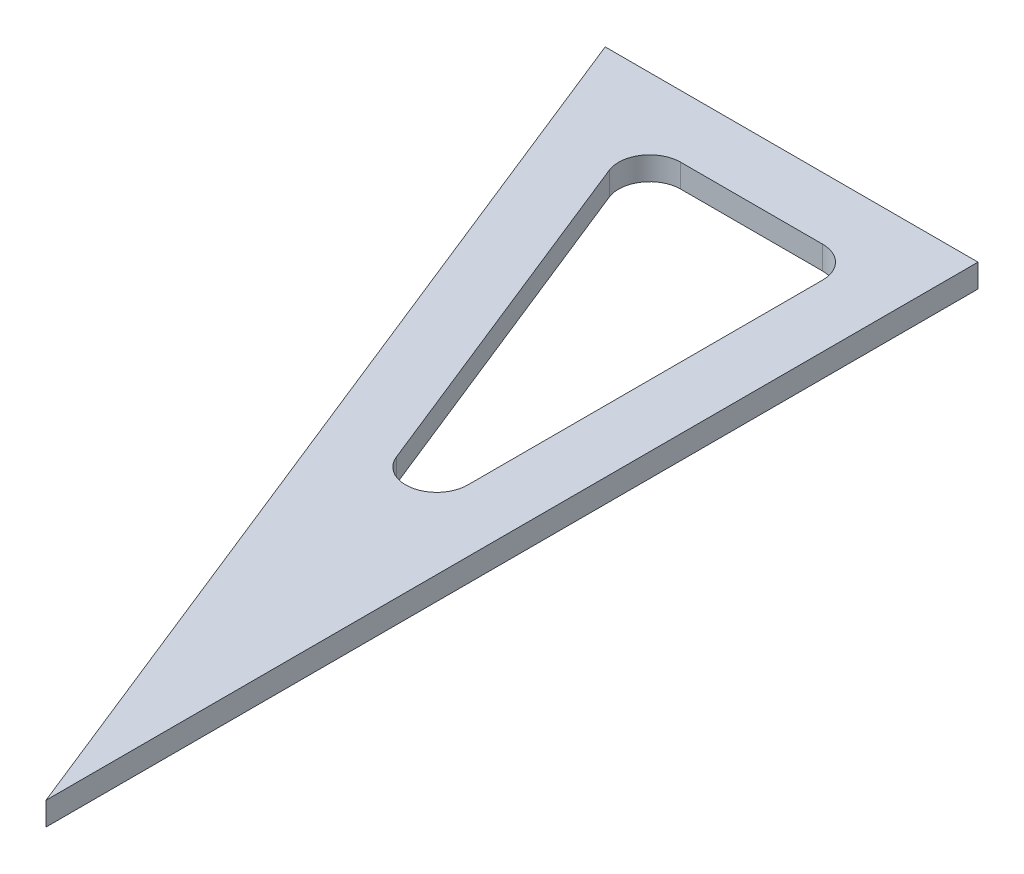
ISO-10303-21;
HEADER;
FILE_DESCRIPTION(('STEP AP214'),'2;1');
FILE_NAME('part.step','',(''),(''),'','','');
FILE_SCHEMA(('AUTOMOTIVE_DESIGN { 1 0 10303 214 1 1 1 1 }'));
ENDSEC;
DATA;
#1=APPLICATION_CONTEXT('core data for automotive mechanical design processes');
#2=APPLICATION_PROTOCOL_DEFINITION('international standard','automotive_design',2000,#1);
#3=PRODUCT_CONTEXT('',#1,'mechanical');
#4=PRODUCT('Part','Part','',(#3));
#5=PRODUCT_RELATED_PRODUCT_CATEGORY('part','',(#4));
#6=PRODUCT_DEFINITION_FORMATION('','',#4);
#7=PRODUCT_DEFINITION_CONTEXT('part definition',#1,'design');
#8=PRODUCT_DEFINITION('design','',#6,#7);
#9=PRODUCT_DEFINITION_SHAPE('','',#8);
#10=(LENGTH_UNIT() NAMED_UNIT(*) SI_UNIT(.MILLI.,.METRE.));
#11=(NAMED_UNIT(*) PLANE_ANGLE_UNIT() SI_UNIT($,.RADIAN.));
#12=(NAMED_UNIT(*) SI_UNIT($,.STERADIAN.) SOLID_ANGLE_UNIT());
#13=UNCERTAINTY_MEASURE_WITH_UNIT(LENGTH_MEASURE(1.E-05),#10,'distance_accuracy_value','');
#14=(GEOMETRIC_REPRESENTATION_CONTEXT(3) GLOBAL_UNCERTAINTY_ASSIGNED_CONTEXT((#13)) GLOBAL_UNIT_ASSIGNED_CONTEXT((#10,
#11,#12)) REPRESENTATION_CONTEXT('',''));
#15=CARTESIAN_POINT('',(0.,0.,0.));
#16=DIRECTION('',(0.,0.,1.));
#17=DIRECTION('',(1.,0.,0.));
#18=AXIS2_PLACEMENT_3D('',#15,#16,#17);
#19=CARTESIAN_POINT('',(-11.3462064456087,218.452208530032,190.5));
#20=DIRECTION('',(-1.,0.,0.));
#21=DIRECTION('',(0.,0.,1.));
#22=AXIS2_PLACEMENT_3D('',#19,#20,#21);
#23=PLANE('',#22);
#24=DIRECTION('',(0.,1.,0.));
#25=VECTOR('',#24,1.);
#26=CARTESIAN_POINT('',(-11.3462064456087,218.452208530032,0.));
#27=LINE('',#26,#25);
#28=CARTESIAN_POINT('',(-11.3462064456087,213.689708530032,0.));
#29=VERTEX_POINT('',#28);
#30=CARTESIAN_POINT('',(-11.3462064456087,218.452208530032,0.));
#31=VERTEX_POINT('',#30);
#32=EDGE_CURVE('E114',#29,#31,#27,.T.);
#33=ORIENTED_EDGE('',*,*,#32,.T.);
#34=DIRECTION('',(0.,0.,-1.));
#35=VECTOR('',#34,1.);
#36=CARTESIAN_POINT('',(-11.3462064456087,218.452208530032,190.5));
#37=LINE('',#36,#35);
#38=CARTESIAN_POINT('',(-11.3462064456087,218.452208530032,190.5));
#39=VERTEX_POINT('',#38);
#40=EDGE_CURVE('E124',#39,#31,#37,.T.);
#41=ORIENTED_EDGE('',*,*,#40,.F.);
#42=DIRECTION('',(0.,1.,0.));
#43=VECTOR('',#42,1.);
#44=CARTESIAN_POINT('',(-11.3462064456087,218.452208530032,190.5));
#45=LINE('',#44,#43);
#46=CARTESIAN_POINT('',(-11.3462064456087,213.689708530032,190.5));
#47=VERTEX_POINT('',#46);
#48=EDGE_CURVE('E108',#47,#39,#45,.T.);
#49=ORIENTED_EDGE('',*,*,#48,.F.);
#50=DIRECTION('',(0.,0.,-1.));
#51=VECTOR('',#50,1.);
#52=CARTESIAN_POINT('',(-11.3462064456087,213.689708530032,190.5));
#53=LINE('',#52,#51);
#54=EDGE_CURVE('E118',#47,#29,#53,.T.);
#55=ORIENTED_EDGE('',*,*,#54,.T.);
#56=EDGE_LOOP('',(#33,#41,#49,#55));
#57=FACE_BOUND('',#56,.T.);
#58=ADVANCED_FACE('F33',(#57),#23,.F.);
#59=CARTESIAN_POINT('',(-11.3462064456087,218.452208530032,190.5));
#60=DIRECTION('',(0.,-1.,0.));
#61=DIRECTION('',(0.,0.,-1.));
#62=AXIS2_PLACEMENT_3D('',#59,#60,#61);
#63=PLANE('',#62);
#64=DIRECTION('',(0.371390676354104,0.,0.928476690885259));
#65=VECTOR('',#64,1.);
#66=CARTESIAN_POINT('',(-68.787887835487,218.452208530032,12.7));
#67=LINE('',#66,#65);
#68=CARTESIAN_POINT('',(-65.3045555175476,218.452208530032,21.4083307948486));
#69=VERTEX_POINT('',#68);
#70=CARTESIAN_POINT('',(-36.2920334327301,218.452208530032,93.9396360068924));
#71=VERTEX_POINT('',#70);
#72=EDGE_CURVE('E165',#69,#71,#67,.T.);
#73=ORIENTED_EDGE('',*,*,#72,.F.);
#74=CARTESIAN_POINT('',(-59.4087285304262,218.452208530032,19.05));
#75=DIRECTION('',(0.,-1.,0.));
#76=DIRECTION('',(0.,0.,-1.));
#77=AXIS2_PLACEMENT_3D('',#74,#75,#76);
#78=CIRCLE('',#77,6.35);
#79=CARTESIAN_POINT('',(-59.4087285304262,218.452208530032,12.7));
#80=VERTEX_POINT('',#79);
#81=EDGE_CURVE('E41',#69,#80,#78,.T.);
#82=ORIENTED_EDGE('',*,*,#81,.T.);
#83=DIRECTION('',(-1.,0.,0.));
#84=VECTOR('',#83,1.);
#85=CARTESIAN_POINT('',(-24.0462064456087,218.452208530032,12.7));
#86=LINE('',#85,#84);
#87=CARTESIAN_POINT('',(-30.3962064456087,218.452208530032,12.7));
#88=VERTEX_POINT('',#87);
#89=EDGE_CURVE('E163',#88,#80,#86,.T.);
#90=ORIENTED_EDGE('',*,*,#89,.F.);
#91=CARTESIAN_POINT('',(-30.3962064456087,218.452208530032,19.05));
#92=DIRECTION('',(0.,-1.,0.));
#93=DIRECTION('',(0.,0.,-1.));
#94=AXIS2_PLACEMENT_3D('',#91,#92,#93);
#95=CIRCLE('',#94,6.35);
#96=CARTESIAN_POINT('',(-24.0462064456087,218.452208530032,19.05));
#97=VERTEX_POINT('',#96);
#98=EDGE_CURVE('E156',#88,#97,#95,.T.);
#99=ORIENTED_EDGE('',*,*,#98,.T.);
#100=DIRECTION('',(0.,0.,-1.));
#101=VECTOR('',#100,1.);
#102=CARTESIAN_POINT('',(-24.0462064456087,218.452208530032,124.554203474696));
#103=LINE('',#102,#101);
#104=CARTESIAN_POINT('',(-24.0462064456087,218.452208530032,91.5813052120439));
#105=VERTEX_POINT('',#104);
#106=EDGE_CURVE('E183',#105,#97,#103,.T.);
#107=ORIENTED_EDGE('',*,*,#106,.F.);
#108=CARTESIAN_POINT('',(-30.3962064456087,218.452208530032,91.5813052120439));
#109=DIRECTION('',(0.,-1.,0.));
#110=DIRECTION('',(0.,0.,-1.));
#111=AXIS2_PLACEMENT_3D('',#108,#109,#110);
#112=CIRCLE('',#111,6.35);
#113=EDGE_CURVE('E152',#105,#71,#112,.T.);
#114=ORIENTED_EDGE('',*,*,#113,.T.);
#115=EDGE_LOOP('',(#73,#82,#90,#99,#107,#114));
#116=FACE_BOUND('',#115,.T.);
#117=DIRECTION('',(-1.,0.,0.));
#118=VECTOR('',#117,1.);
#119=CARTESIAN_POINT('',(-11.3462064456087,218.452208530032,0.));
#120=LINE('',#119,#118);
#121=CARTESIAN_POINT('',(-87.5462064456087,218.452208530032,0.));
#122=VERTEX_POINT('',#121);
#123=EDGE_CURVE('E133',#31,#122,#120,.T.);
#124=ORIENTED_EDGE('',*,*,#123,.T.);
#125=DIRECTION('',(-0.371390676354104,0.,-0.928476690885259));
#126=VECTOR('',#125,1.);
#127=CARTESIAN_POINT('',(-87.5462064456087,218.452208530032,0.));
#128=LINE('',#127,#126);
#129=EDGE_CURVE('E115',#39,#122,#128,.T.);
#130=ORIENTED_EDGE('',*,*,#129,.F.);
#131=ORIENTED_EDGE('',*,*,#40,.T.);
#132=EDGE_LOOP('',(#124,#130,#131));
#133=FACE_BOUND('',#132,.T.);
#134=ADVANCED_FACE('F161',(#116,#133),#63,.F.);
#135=CARTESIAN_POINT('',(-11.3462064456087,213.689708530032,190.5));
#136=DIRECTION('',(0.,1.,0.));
#137=DIRECTION('',(0.,0.,1.));
#138=AXIS2_PLACEMENT_3D('',#135,#136,#137);
#139=PLANE('',#138);
#140=DIRECTION('',(0.371390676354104,0.,0.928476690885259));
#141=VECTOR('',#140,1.);
#142=CARTESIAN_POINT('',(-68.787887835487,213.689708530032,12.7));
#143=LINE('',#142,#141);
#144=CARTESIAN_POINT('',(-65.3045555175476,213.689708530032,21.4083307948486));
#145=VERTEX_POINT('',#144);
#146=CARTESIAN_POINT('',(-36.2920334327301,213.689708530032,93.9396360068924));
#147=VERTEX_POINT('',#146);
#148=EDGE_CURVE('E174',#145,#147,#143,.T.);
#149=ORIENTED_EDGE('',*,*,#148,.T.);
#150=CARTESIAN_POINT('',(-30.3962064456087,213.689708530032,91.5813052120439));
#151=DIRECTION('',(0.,1.,0.));
#152=DIRECTION('',(0.,0.,1.));
#153=AXIS2_PLACEMENT_3D('',#150,#151,#152);
#154=CIRCLE('',#153,6.35);
#155=CARTESIAN_POINT('',(-24.0462064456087,213.689708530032,91.5813052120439));
#156=VERTEX_POINT('',#155);
#157=EDGE_CURVE('E154',#147,#156,#154,.T.);
#158=ORIENTED_EDGE('',*,*,#157,.T.);
#159=DIRECTION('',(0.,0.,-1.));
#160=VECTOR('',#159,1.);
#161=CARTESIAN_POINT('',(-24.0462064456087,213.689708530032,124.554203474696));
#162=LINE('',#161,#160);
#163=CARTESIAN_POINT('',(-24.0462064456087,213.689708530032,19.05));
#164=VERTEX_POINT('',#163);
#165=EDGE_CURVE('E180',#156,#164,#162,.T.);
#166=ORIENTED_EDGE('',*,*,#165,.T.);
#167=CARTESIAN_POINT('',(-30.3962064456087,213.689708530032,19.05));
#168=DIRECTION('',(0.,1.,0.));
#169=DIRECTION('',(0.,0.,1.));
#170=AXIS2_PLACEMENT_3D('',#167,#168,#169);
#171=CIRCLE('',#170,6.35);
#172=CARTESIAN_POINT('',(-30.3962064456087,213.689708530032,12.7));
#173=VERTEX_POINT('',#172);
#174=EDGE_CURVE('E55',#164,#173,#171,.T.);
#175=ORIENTED_EDGE('',*,*,#174,.T.);
#176=DIRECTION('',(-1.,0.,0.));
#177=VECTOR('',#176,1.);
#178=CARTESIAN_POINT('',(-24.0462064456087,213.689708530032,12.7));
#179=LINE('',#178,#177);
#180=CARTESIAN_POINT('',(-59.4087285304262,213.689708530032,12.7));
#181=VERTEX_POINT('',#180);
#182=EDGE_CURVE('E176',#173,#181,#179,.T.);
#183=ORIENTED_EDGE('',*,*,#182,.T.);
#184=CARTESIAN_POINT('',(-59.4087285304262,213.689708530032,19.05));
#185=DIRECTION('',(0.,1.,0.));
#186=DIRECTION('',(0.,0.,1.));
#187=AXIS2_PLACEMENT_3D('',#184,#185,#186);
#188=CIRCLE('',#187,6.35);
#189=EDGE_CURVE('E11',#181,#145,#188,.T.);
#190=ORIENTED_EDGE('',*,*,#189,.T.);
#191=EDGE_LOOP('',(#149,#158,#166,#175,#183,#190));
#192=FACE_BOUND('',#191,.T.);
#193=ORIENTED_EDGE('',*,*,#54,.F.);
#194=DIRECTION('',(-0.371390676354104,0.,-0.928476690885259));
#195=VECTOR('',#194,1.);
#196=CARTESIAN_POINT('',(-87.5462064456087,213.689708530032,0.));
#197=LINE('',#196,#195);
#198=CARTESIAN_POINT('',(-87.5462064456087,213.689708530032,0.));
#199=VERTEX_POINT('',#198);
#200=EDGE_CURVE('E104',#47,#199,#197,.T.);
#201=ORIENTED_EDGE('',*,*,#200,.T.);
#202=DIRECTION('',(1.,0.,0.));
#203=VECTOR('',#202,1.);
#204=CARTESIAN_POINT('',(-11.3462064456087,213.689708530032,0.));
#205=LINE('',#204,#203);
#206=EDGE_CURVE('E120',#199,#29,#205,.T.);
#207=ORIENTED_EDGE('',*,*,#206,.T.);
#208=EDGE_LOOP('',(#193,#201,#207));
#209=FACE_BOUND('',#208,.T.);
#210=ADVANCED_FACE('F119',(#192,#209),#139,.F.);
#211=CARTESIAN_POINT('',(-11.3462064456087,213.689708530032,0.));
#212=DIRECTION('',(0.,0.,-1.));
#213=DIRECTION('',(-1.,0.,0.));
#214=AXIS2_PLACEMENT_3D('',#211,#212,#213);
#215=PLANE('',#214);
#216=ORIENTED_EDGE('',*,*,#32,.F.);
#217=ORIENTED_EDGE('',*,*,#206,.F.);
#218=DIRECTION('',(0.,-1.,0.));
#219=VECTOR('',#218,1.);
#220=CARTESIAN_POINT('',(-87.5462064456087,218.452208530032,0.));
#221=LINE('',#220,#219);
#222=EDGE_CURVE('E111',#122,#199,#221,.T.);
#223=ORIENTED_EDGE('',*,*,#222,.F.);
#224=ORIENTED_EDGE('',*,*,#123,.F.);
#225=EDGE_LOOP('',(#216,#217,#223,#224));
#226=FACE_BOUND('',#225,.T.);
#227=ADVANCED_FACE('F213',(#226),#215,.T.);
#228=CARTESIAN_POINT('',(-87.5462064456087,213.689708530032,0.));
#229=DIRECTION('',(0.928476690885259,0.,-0.371390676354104));
#230=DIRECTION('',(-0.371390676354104,0.,-0.928476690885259));
#231=AXIS2_PLACEMENT_3D('',#228,#229,#230);
#232=PLANE('',#231);
#233=ORIENTED_EDGE('',*,*,#129,.T.);
#234=ORIENTED_EDGE('',*,*,#222,.T.);
#235=ORIENTED_EDGE('',*,*,#200,.F.);
#236=ORIENTED_EDGE('',*,*,#48,.T.);
#237=EDGE_LOOP('',(#233,#234,#235,#236));
#238=FACE_BOUND('',#237,.T.);
#239=ADVANCED_FACE('F106',(#238),#232,.F.);
#240=CARTESIAN_POINT('',(-24.0462064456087,213.689708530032,12.7));
#241=DIRECTION('',(0.,0.,-1.));
#242=DIRECTION('',(-1.,0.,0.));
#243=AXIS2_PLACEMENT_3D('',#240,#241,#242);
#244=PLANE('',#243);
#245=ORIENTED_EDGE('',*,*,#182,.F.);
#246=DIRECTION('',(0.,1.,0.));
#247=VECTOR('',#246,1.);
#248=CARTESIAN_POINT('',(-30.3962064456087,218.452208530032,12.7));
#249=LINE('',#248,#247);
#250=EDGE_CURVE('E149',#173,#88,#249,.T.);
#251=ORIENTED_EDGE('',*,*,#250,.T.);
#252=ORIENTED_EDGE('',*,*,#89,.T.);
#253=DIRECTION('',(0.,1.,0.));
#254=VECTOR('',#253,1.);
#255=CARTESIAN_POINT('',(-59.4087285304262,213.689708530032,12.7));
#256=LINE('',#255,#254);
#257=EDGE_CURVE('E48',#80,#181,#256,.F.);
#258=ORIENTED_EDGE('',*,*,#257,.T.);
#259=EDGE_LOOP('',(#245,#251,#252,#258));
#260=FACE_BOUND('',#259,.T.);
#261=ADVANCED_FACE('F168',(#260),#244,.F.);
#262=CARTESIAN_POINT('',(-24.0462064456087,213.689708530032,124.554203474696));
#263=DIRECTION('',(1.,0.,0.));
#264=DIRECTION('',(0.,0.,-1.));
#265=AXIS2_PLACEMENT_3D('',#262,#263,#264);
#266=PLANE('',#265);
#267=ORIENTED_EDGE('',*,*,#165,.F.);
#268=DIRECTION('',(0.,1.,0.));
#269=VECTOR('',#268,1.);
#270=CARTESIAN_POINT('',(-24.0462064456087,218.452208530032,91.5813052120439));
#271=LINE('',#270,#269);
#272=EDGE_CURVE('E140',#156,#105,#271,.T.);
#273=ORIENTED_EDGE('',*,*,#272,.T.);
#274=ORIENTED_EDGE('',*,*,#106,.T.);
#275=DIRECTION('',(0.,1.,0.));
#276=VECTOR('',#275,1.);
#277=CARTESIAN_POINT('',(-24.0462064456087,213.689708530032,19.05));
#278=LINE('',#277,#276);
#279=EDGE_CURVE('E138',#97,#164,#278,.F.);
#280=ORIENTED_EDGE('',*,*,#279,.T.);
#281=EDGE_LOOP('',(#267,#273,#274,#280));
#282=FACE_BOUND('',#281,.T.);
#283=ADVANCED_FACE('F192',(#282),#266,.F.);
#284=CARTESIAN_POINT('',(-68.787887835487,213.689708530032,12.7));
#285=DIRECTION('',(-0.928476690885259,0.,0.371390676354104));
#286=DIRECTION('',(0.371390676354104,0.,0.928476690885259));
#287=AXIS2_PLACEMENT_3D('',#284,#285,#286);
#288=PLANE('',#287);
#289=ORIENTED_EDGE('',*,*,#72,.T.);
#290=DIRECTION('',(0.,1.,0.));
#291=VECTOR('',#290,1.);
#292=CARTESIAN_POINT('',(-36.2920334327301,213.689708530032,93.9396360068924));
#293=LINE('',#292,#291);
#294=EDGE_CURVE('E146',#71,#147,#293,.F.);
#295=ORIENTED_EDGE('',*,*,#294,.T.);
#296=ORIENTED_EDGE('',*,*,#148,.F.);
#297=DIRECTION('',(0.,1.,0.));
#298=VECTOR('',#297,1.);
#299=CARTESIAN_POINT('',(-65.3045555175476,218.452208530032,21.4083307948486));
#300=LINE('',#299,#298);
#301=EDGE_CURVE('E143',#145,#69,#300,.T.);
#302=ORIENTED_EDGE('',*,*,#301,.T.);
#303=EDGE_LOOP('',(#289,#295,#296,#302));
#304=FACE_BOUND('',#303,.T.);
#305=ADVANCED_FACE('F178',(#304),#288,.F.);
#306=CARTESIAN_POINT('',(-30.3962064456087,213.689708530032,91.5813052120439));
#307=DIRECTION('',(0.,-1.,0.));
#308=DIRECTION('',(0.,0.,-1.));
#309=AXIS2_PLACEMENT_3D('',#306,#307,#308);
#310=CYLINDRICAL_SURFACE('',#309,6.35);
#311=ORIENTED_EDGE('',*,*,#157,.F.);
#312=ORIENTED_EDGE('',*,*,#294,.F.);
#313=ORIENTED_EDGE('',*,*,#113,.F.);
#314=ORIENTED_EDGE('',*,*,#272,.F.);
#315=EDGE_LOOP('',(#311,#312,#313,#314));
#316=FACE_BOUND('',#315,.T.);
#317=ADVANCED_FACE('F197',(#316),#310,.F.);
#318=CARTESIAN_POINT('',(-30.3962064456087,213.689708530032,19.05));
#319=DIRECTION('',(0.,-1.,0.));
#320=DIRECTION('',(0.,0.,-1.));
#321=AXIS2_PLACEMENT_3D('',#318,#319,#320);
#322=CYLINDRICAL_SURFACE('',#321,6.35);
#323=ORIENTED_EDGE('',*,*,#174,.F.);
#324=ORIENTED_EDGE('',*,*,#279,.F.);
#325=ORIENTED_EDGE('',*,*,#98,.F.);
#326=ORIENTED_EDGE('',*,*,#250,.F.);
#327=EDGE_LOOP('',(#323,#324,#325,#326));
#328=FACE_BOUND('',#327,.T.);
#329=ADVANCED_FACE('F195',(#328),#322,.F.);
#330=CARTESIAN_POINT('',(-59.4087285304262,213.689708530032,19.05));
#331=DIRECTION('',(0.,-1.,0.));
#332=DIRECTION('',(0.,0.,-1.));
#333=AXIS2_PLACEMENT_3D('',#330,#331,#332);
#334=CYLINDRICAL_SURFACE('',#333,6.35);
#335=ORIENTED_EDGE('',*,*,#189,.F.);
#336=ORIENTED_EDGE('',*,*,#257,.F.);
#337=ORIENTED_EDGE('',*,*,#81,.F.);
#338=ORIENTED_EDGE('',*,*,#301,.F.);
#339=EDGE_LOOP('',(#335,#336,#337,#338));
#340=FACE_BOUND('',#339,.T.);
#341=ADVANCED_FACE('F35',(#340),#334,.F.);
#342=CLOSED_SHELL('',(#58,#134,#210,#227,#239,#261,#283,#305,#317,#329,#341));
#343=MANIFOLD_SOLID_BREP('B2',#342);
#344=ADVANCED_BREP_SHAPE_REPRESENTATION('',(#18,#343),#14);
#345=SHAPE_DEFINITION_REPRESENTATION(#9,#344);
ENDSEC;
END-ISO-10303-21;
